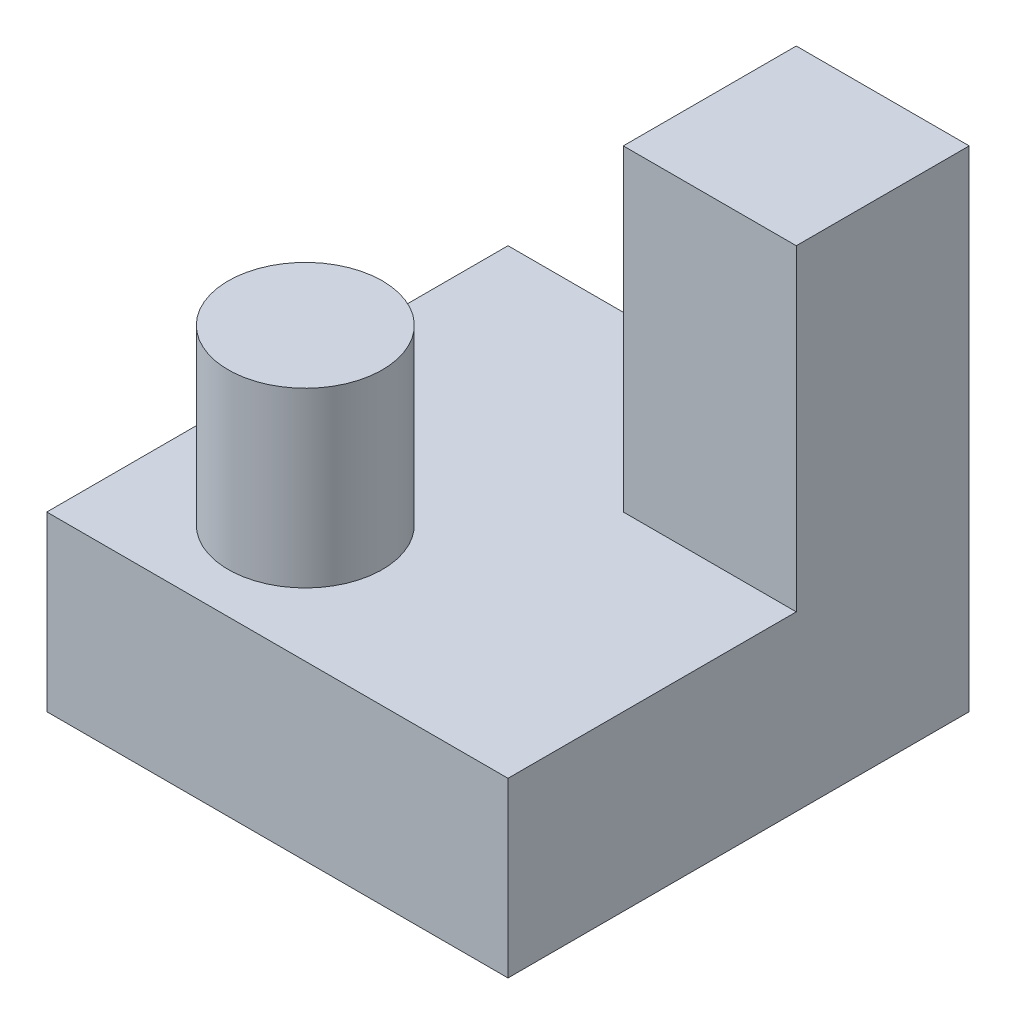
ISO-10303-21;
HEADER;
FILE_DESCRIPTION(('STEP AP214'),'2;1');
FILE_NAME('part.step','',(''),(''),'','','');
FILE_SCHEMA(('AUTOMOTIVE_DESIGN { 1 0 10303 214 1 1 1 1 }'));
ENDSEC;
DATA;
#1=APPLICATION_CONTEXT('core data for automotive mechanical design processes');
#2=APPLICATION_PROTOCOL_DEFINITION('international standard','automotive_design',2000,#1);
#3=PRODUCT_CONTEXT('',#1,'mechanical');
#4=PRODUCT('Part','Part','',(#3));
#5=PRODUCT_RELATED_PRODUCT_CATEGORY('part','',(#4));
#6=PRODUCT_DEFINITION_FORMATION('','',#4);
#7=PRODUCT_DEFINITION_CONTEXT('part definition',#1,'design');
#8=PRODUCT_DEFINITION('design','',#6,#7);
#9=PRODUCT_DEFINITION_SHAPE('','',#8);
#10=(LENGTH_UNIT() NAMED_UNIT(*) SI_UNIT(.MILLI.,.METRE.));
#11=(NAMED_UNIT(*) PLANE_ANGLE_UNIT() SI_UNIT($,.RADIAN.));
#12=(NAMED_UNIT(*) SI_UNIT($,.STERADIAN.) SOLID_ANGLE_UNIT());
#13=UNCERTAINTY_MEASURE_WITH_UNIT(LENGTH_MEASURE(1.E-05),#10,'distance_accuracy_value','');
#14=(GEOMETRIC_REPRESENTATION_CONTEXT(3) GLOBAL_UNCERTAINTY_ASSIGNED_CONTEXT((#13)) GLOBAL_UNIT_ASSIGNED_CONTEXT((#10,
#11,#12)) REPRESENTATION_CONTEXT('',''));
#15=CARTESIAN_POINT('',(0.,0.,0.));
#16=DIRECTION('',(0.,0.,1.));
#17=DIRECTION('',(1.,0.,0.));
#18=AXIS2_PLACEMENT_3D('',#15,#16,#17);
#19=CARTESIAN_POINT('',(0.,38.1,-101.6));
#20=DIRECTION('',(0.,-1.,0.));
#21=DIRECTION('',(0.,0.,-1.));
#22=AXIS2_PLACEMENT_3D('',#19,#20,#21);
#23=PLANE('',#22);
#24=CARTESIAN_POINT('',(30.963637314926,38.1,-25.9876638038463));
#25=DIRECTION('',(0.,-1.,0.));
#26=DIRECTION('',(0.,0.,-1.));
#27=AXIS2_PLACEMENT_3D('',#24,#25,#26);
#28=CIRCLE('',#27,16.9839539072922);
#29=CARTESIAN_POINT('',(30.963637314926,38.1,-42.9716177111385));
#30=VERTEX_POINT('',#29);
#31=EDGE_CURVE('E11',#30,#30,#28,.F.);
#32=ORIENTED_EDGE('',*,*,#31,.F.);
#33=EDGE_LOOP('',(#32));
#34=FACE_BOUND('',#33,.T.);
#35=DIRECTION('',(0.,0.,1.));
#36=VECTOR('',#35,1.);
#37=CARTESIAN_POINT('',(63.5,38.1,-101.6));
#38=LINE('',#37,#36);
#39=CARTESIAN_POINT('',(63.5,38.1,-101.6));
#40=VERTEX_POINT('',#39);
#41=CARTESIAN_POINT('',(63.5,38.1,-63.5));
#42=VERTEX_POINT('',#41);
#43=EDGE_CURVE('E117',#40,#42,#38,.T.);
#44=ORIENTED_EDGE('',*,*,#43,.F.);
#45=DIRECTION('',(-1.,0.,0.));
#46=VECTOR('',#45,1.);
#47=CARTESIAN_POINT('',(0.,38.1,-101.6));
#48=LINE('',#47,#46);
#49=CARTESIAN_POINT('',(0.,38.1,-101.6));
#50=VERTEX_POINT('',#49);
#51=EDGE_CURVE('E140',#40,#50,#48,.T.);
#52=ORIENTED_EDGE('',*,*,#51,.T.);
#53=DIRECTION('',(0.,0.,1.));
#54=VECTOR('',#53,1.);
#55=CARTESIAN_POINT('',(0.,38.1,0.));
#56=LINE('',#55,#54);
#57=CARTESIAN_POINT('',(0.,38.1,0.));
#58=VERTEX_POINT('',#57);
#59=EDGE_CURVE('E133',#50,#58,#56,.T.);
#60=ORIENTED_EDGE('',*,*,#59,.T.);
#61=DIRECTION('',(1.,0.,0.));
#62=VECTOR('',#61,1.);
#63=CARTESIAN_POINT('',(0.,38.1,0.));
#64=LINE('',#63,#62);
#65=CARTESIAN_POINT('',(101.6,38.1,0.));
#66=VERTEX_POINT('',#65);
#67=EDGE_CURVE('E136',#58,#66,#64,.T.);
#68=ORIENTED_EDGE('',*,*,#67,.T.);
#69=DIRECTION('',(0.,0.,-1.));
#70=VECTOR('',#69,1.);
#71=CARTESIAN_POINT('',(101.6,38.1,0.));
#72=LINE('',#71,#70);
#73=CARTESIAN_POINT('',(101.6,38.1,-63.5));
#74=VERTEX_POINT('',#73);
#75=EDGE_CURVE('E51',#66,#74,#72,.T.);
#76=ORIENTED_EDGE('',*,*,#75,.T.);
#77=DIRECTION('',(1.,0.,0.));
#78=VECTOR('',#77,1.);
#79=CARTESIAN_POINT('',(101.6,38.1,-63.5));
#80=LINE('',#79,#78);
#81=EDGE_CURVE('E46',#42,#74,#80,.T.);
#82=ORIENTED_EDGE('',*,*,#81,.F.);
#83=EDGE_LOOP('',(#44,#52,#60,#68,#76,#82));
#84=FACE_BOUND('',#83,.T.);
#85=ADVANCED_FACE('F31',(#34,#84),#23,.F.);
#86=CARTESIAN_POINT('',(0.,38.1,0.));
#87=DIRECTION('',(1.,0.,0.));
#88=DIRECTION('',(0.,0.,-1.));
#89=AXIS2_PLACEMENT_3D('',#86,#87,#88);
#90=PLANE('',#89);
#91=DIRECTION('',(0.,0.,1.));
#92=VECTOR('',#91,1.);
#93=CARTESIAN_POINT('',(0.,0.,0.));
#94=LINE('',#93,#92);
#95=CARTESIAN_POINT('',(0.,0.,-101.6));
#96=VERTEX_POINT('',#95);
#97=CARTESIAN_POINT('',(0.,0.,0.));
#98=VERTEX_POINT('',#97);
#99=EDGE_CURVE('E132',#96,#98,#94,.T.);
#100=ORIENTED_EDGE('',*,*,#99,.T.);
#101=DIRECTION('',(0.,-1.,0.));
#102=VECTOR('',#101,1.);
#103=CARTESIAN_POINT('',(0.,38.1,0.));
#104=LINE('',#103,#102);
#105=EDGE_CURVE('E39',#58,#98,#104,.T.);
#106=ORIENTED_EDGE('',*,*,#105,.F.);
#107=ORIENTED_EDGE('',*,*,#59,.F.);
#108=DIRECTION('',(0.,-1.,0.));
#109=VECTOR('',#108,1.);
#110=CARTESIAN_POINT('',(0.,38.1,-101.6));
#111=LINE('',#110,#109);
#112=EDGE_CURVE('E101',#50,#96,#111,.T.);
#113=ORIENTED_EDGE('',*,*,#112,.T.);
#114=EDGE_LOOP('',(#100,#106,#107,#113));
#115=FACE_BOUND('',#114,.T.);
#116=ADVANCED_FACE('F33',(#115),#90,.F.);
#117=CARTESIAN_POINT('',(0.,38.1,0.));
#118=DIRECTION('',(0.,0.,-1.));
#119=DIRECTION('',(-1.,0.,0.));
#120=AXIS2_PLACEMENT_3D('',#117,#118,#119);
#121=PLANE('',#120);
#122=DIRECTION('',(1.,0.,0.));
#123=VECTOR('',#122,1.);
#124=CARTESIAN_POINT('',(0.,0.,0.));
#125=LINE('',#124,#123);
#126=CARTESIAN_POINT('',(101.6,0.,0.));
#127=VERTEX_POINT('',#126);
#128=EDGE_CURVE('E144',#98,#127,#125,.T.);
#129=ORIENTED_EDGE('',*,*,#128,.T.);
#130=DIRECTION('',(0.,-1.,0.));
#131=VECTOR('',#130,1.);
#132=CARTESIAN_POINT('',(101.6,38.1,0.));
#133=LINE('',#132,#131);
#134=EDGE_CURVE('E100',#66,#127,#133,.T.);
#135=ORIENTED_EDGE('',*,*,#134,.F.);
#136=ORIENTED_EDGE('',*,*,#67,.F.);
#137=ORIENTED_EDGE('',*,*,#105,.T.);
#138=EDGE_LOOP('',(#129,#135,#136,#137));
#139=FACE_BOUND('',#138,.T.);
#140=ADVANCED_FACE('F153',(#139),#121,.F.);
#141=CARTESIAN_POINT('',(101.6,38.1,0.));
#142=DIRECTION('',(-1.,0.,0.));
#143=DIRECTION('',(0.,0.,1.));
#144=AXIS2_PLACEMENT_3D('',#141,#142,#143);
#145=PLANE('',#144);
#146=DIRECTION('',(0.,0.,-1.));
#147=VECTOR('',#146,1.);
#148=CARTESIAN_POINT('',(101.6,0.,0.));
#149=LINE('',#148,#147);
#150=CARTESIAN_POINT('',(101.6,0.,-101.6));
#151=VERTEX_POINT('',#150);
#152=EDGE_CURVE('E97',#127,#151,#149,.T.);
#153=ORIENTED_EDGE('',*,*,#152,.T.);
#154=DIRECTION('',(0.,-1.,0.));
#155=VECTOR('',#154,1.);
#156=CARTESIAN_POINT('',(101.6,38.1,-101.6));
#157=LINE('',#156,#155);
#158=CARTESIAN_POINT('',(101.6,107.95,-101.6));
#159=VERTEX_POINT('',#158);
#160=EDGE_CURVE('E89',#159,#151,#157,.T.);
#161=ORIENTED_EDGE('',*,*,#160,.F.);
#162=DIRECTION('',(0.,0.,-1.));
#163=VECTOR('',#162,1.);
#164=CARTESIAN_POINT('',(101.6,107.95,-101.6));
#165=LINE('',#164,#163);
#166=CARTESIAN_POINT('',(101.6,107.95,-63.5));
#167=VERTEX_POINT('',#166);
#168=EDGE_CURVE('E94',#167,#159,#165,.T.);
#169=ORIENTED_EDGE('',*,*,#168,.F.);
#170=DIRECTION('',(0.,-1.,0.));
#171=VECTOR('',#170,1.);
#172=CARTESIAN_POINT('',(101.6,107.95,-63.5));
#173=LINE('',#172,#171);
#174=EDGE_CURVE('E122',#167,#74,#173,.T.);
#175=ORIENTED_EDGE('',*,*,#174,.T.);
#176=ORIENTED_EDGE('',*,*,#75,.F.);
#177=ORIENTED_EDGE('',*,*,#134,.T.);
#178=EDGE_LOOP('',(#153,#161,#169,#175,#176,#177));
#179=FACE_BOUND('',#178,.T.);
#180=ADVANCED_FACE('F91',(#179),#145,.F.);
#181=CARTESIAN_POINT('',(0.,38.1,-101.6));
#182=DIRECTION('',(0.,0.,1.));
#183=DIRECTION('',(1.,0.,0.));
#184=AXIS2_PLACEMENT_3D('',#181,#182,#183);
#185=PLANE('',#184);
#186=DIRECTION('',(-1.,0.,0.));
#187=VECTOR('',#186,1.);
#188=CARTESIAN_POINT('',(0.,0.,-101.6));
#189=LINE('',#188,#187);
#190=EDGE_CURVE('E137',#151,#96,#189,.T.);
#191=ORIENTED_EDGE('',*,*,#190,.T.);
#192=ORIENTED_EDGE('',*,*,#112,.F.);
#193=ORIENTED_EDGE('',*,*,#51,.F.);
#194=DIRECTION('',(0.,-1.,0.));
#195=VECTOR('',#194,1.);
#196=CARTESIAN_POINT('',(63.5,107.95,-101.6));
#197=LINE('',#196,#195);
#198=CARTESIAN_POINT('',(63.5,107.95,-101.6));
#199=VERTEX_POINT('',#198);
#200=EDGE_CURVE('E107',#199,#40,#197,.T.);
#201=ORIENTED_EDGE('',*,*,#200,.F.);
#202=DIRECTION('',(-1.,0.,0.));
#203=VECTOR('',#202,1.);
#204=CARTESIAN_POINT('',(101.6,107.95,-101.6));
#205=LINE('',#204,#203);
#206=EDGE_CURVE('E104',#159,#199,#205,.T.);
#207=ORIENTED_EDGE('',*,*,#206,.F.);
#208=ORIENTED_EDGE('',*,*,#160,.T.);
#209=EDGE_LOOP('',(#191,#192,#193,#201,#207,#208));
#210=FACE_BOUND('',#209,.T.);
#211=ADVANCED_FACE('F105',(#210),#185,.F.);
#212=CARTESIAN_POINT('',(0.,0.,-101.6));
#213=DIRECTION('',(0.,-1.,0.));
#214=DIRECTION('',(0.,0.,-1.));
#215=AXIS2_PLACEMENT_3D('',#212,#213,#214);
#216=PLANE('',#215);
#217=ORIENTED_EDGE('',*,*,#99,.F.);
#218=ORIENTED_EDGE('',*,*,#190,.F.);
#219=ORIENTED_EDGE('',*,*,#152,.F.);
#220=ORIENTED_EDGE('',*,*,#128,.F.);
#221=EDGE_LOOP('',(#217,#218,#219,#220));
#222=FACE_BOUND('',#221,.T.);
#223=ADVANCED_FACE('F160',(#222),#216,.T.);
#224=CARTESIAN_POINT('',(30.963637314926,76.2,-25.9876638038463));
#225=DIRECTION('',(0.,-1.,0.));
#226=DIRECTION('',(0.,0.,-1.));
#227=AXIS2_PLACEMENT_3D('',#224,#225,#226);
#228=CYLINDRICAL_SURFACE('',#227,16.9839539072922);
#229=CARTESIAN_POINT('',(30.963637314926,76.2,-25.9876638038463));
#230=DIRECTION('',(0.,1.,0.));
#231=DIRECTION('',(0.,0.,1.));
#232=AXIS2_PLACEMENT_3D('',#229,#230,#231);
#233=CIRCLE('',#232,16.9839539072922);
#234=CARTESIAN_POINT('',(30.963637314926,76.2,-42.9716177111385));
#235=VERTEX_POINT('',#234);
#236=EDGE_CURVE('E129',#235,#235,#233,.T.);
#237=CARTESIAN_POINT('',(30.963637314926,76.2,-42.9716177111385));
#238=CARTESIAN_POINT('',(30.963637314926,75.803125,-42.9716177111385));
#239=CARTESIAN_POINT('',(30.963637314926,75.40625,-42.9716177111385));
#240=CARTESIAN_POINT('',(30.963637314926,74.6125,-42.9716177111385));
#241=CARTESIAN_POINT('',(30.963637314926,74.215625,-42.9716177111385));
#242=CARTESIAN_POINT('',(30.963637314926,73.421875,-42.9716177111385));
#243=CARTESIAN_POINT('',(30.963637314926,73.025,-42.9716177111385));
#244=CARTESIAN_POINT('',(30.963637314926,72.23125,-42.9716177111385));
#245=CARTESIAN_POINT('',(30.963637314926,71.834375,-42.9716177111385));
#246=CARTESIAN_POINT('',(30.963637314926,71.040625,-42.9716177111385));
#247=CARTESIAN_POINT('',(30.963637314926,70.64375,-42.9716177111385));
#248=CARTESIAN_POINT('',(30.963637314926,69.85,-42.9716177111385));
#249=CARTESIAN_POINT('',(30.963637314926,69.453125,-42.9716177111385));
#250=CARTESIAN_POINT('',(30.963637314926,68.659375,-42.9716177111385));
#251=CARTESIAN_POINT('',(30.963637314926,68.2625,-42.9716177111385));
#252=CARTESIAN_POINT('',(30.963637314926,67.46875,-42.9716177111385));
#253=CARTESIAN_POINT('',(30.963637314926,67.071875,-42.9716177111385));
#254=CARTESIAN_POINT('',(30.963637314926,66.278125,-42.9716177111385));
#255=CARTESIAN_POINT('',(30.963637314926,65.88125,-42.9716177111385));
#256=CARTESIAN_POINT('',(30.963637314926,65.0875,-42.9716177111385));
#257=CARTESIAN_POINT('',(30.963637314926,64.690625,-42.9716177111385));
#258=CARTESIAN_POINT('',(30.963637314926,63.896875,-42.9716177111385));
#259=CARTESIAN_POINT('',(30.963637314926,63.5,-42.9716177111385));
#260=CARTESIAN_POINT('',(30.963637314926,62.70625,-42.9716177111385));
#261=CARTESIAN_POINT('',(30.963637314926,62.309375,-42.9716177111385));
#262=CARTESIAN_POINT('',(30.963637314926,61.515625,-42.9716177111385));
#263=CARTESIAN_POINT('',(30.963637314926,61.11875,-42.9716177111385));
#264=CARTESIAN_POINT('',(30.963637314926,60.325,-42.9716177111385));
#265=CARTESIAN_POINT('',(30.963637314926,59.928125,-42.9716177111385));
#266=CARTESIAN_POINT('',(30.963637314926,59.134375,-42.9716177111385));
#267=CARTESIAN_POINT('',(30.963637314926,58.7375,-42.9716177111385));
#268=CARTESIAN_POINT('',(30.963637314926,57.94375,-42.9716177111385));
#269=CARTESIAN_POINT('',(30.963637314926,57.546875,-42.9716177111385));
#270=CARTESIAN_POINT('',(30.963637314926,56.753125,-42.9716177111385));
#271=CARTESIAN_POINT('',(30.963637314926,56.35625,-42.9716177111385));
#272=CARTESIAN_POINT('',(30.963637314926,55.5625,-42.9716177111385));
#273=CARTESIAN_POINT('',(30.963637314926,55.165625,-42.9716177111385));
#274=CARTESIAN_POINT('',(30.963637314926,54.371875,-42.9716177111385));
#275=CARTESIAN_POINT('',(30.963637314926,53.975,-42.9716177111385));
#276=CARTESIAN_POINT('',(30.963637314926,53.18125,-42.9716177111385));
#277=CARTESIAN_POINT('',(30.963637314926,52.784375,-42.9716177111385));
#278=CARTESIAN_POINT('',(30.963637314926,51.990625,-42.9716177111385));
#279=CARTESIAN_POINT('',(30.963637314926,51.59375,-42.9716177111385));
#280=CARTESIAN_POINT('',(30.963637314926,50.8,-42.9716177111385));
#281=CARTESIAN_POINT('',(30.963637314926,50.403125,-42.9716177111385));
#282=CARTESIAN_POINT('',(30.963637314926,49.609375,-42.9716177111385));
#283=CARTESIAN_POINT('',(30.963637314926,49.2125,-42.9716177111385));
#284=CARTESIAN_POINT('',(30.963637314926,48.41875,-42.9716177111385));
#285=CARTESIAN_POINT('',(30.963637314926,48.021875,-42.9716177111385));
#286=CARTESIAN_POINT('',(30.963637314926,47.228125,-42.9716177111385));
#287=CARTESIAN_POINT('',(30.963637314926,46.83125,-42.9716177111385));
#288=CARTESIAN_POINT('',(30.963637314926,46.0375,-42.9716177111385));
#289=CARTESIAN_POINT('',(30.963637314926,45.640625,-42.9716177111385));
#290=CARTESIAN_POINT('',(30.963637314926,44.846875,-42.9716177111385));
#291=CARTESIAN_POINT('',(30.963637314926,44.45,-42.9716177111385));
#292=CARTESIAN_POINT('',(30.963637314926,43.65625,-42.9716177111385));
#293=CARTESIAN_POINT('',(30.963637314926,43.259375,-42.9716177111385));
#294=CARTESIAN_POINT('',(30.963637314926,42.465625,-42.9716177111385));
#295=CARTESIAN_POINT('',(30.963637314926,42.06875,-42.9716177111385));
#296=CARTESIAN_POINT('',(30.963637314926,41.275,-42.9716177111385));
#297=CARTESIAN_POINT('',(30.963637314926,40.878125,-42.9716177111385));
#298=CARTESIAN_POINT('',(30.963637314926,40.084375,-42.9716177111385));
#299=CARTESIAN_POINT('',(30.963637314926,39.6875,-42.9716177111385));
#300=CARTESIAN_POINT('',(30.963637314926,38.89375,-42.9716177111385));
#301=CARTESIAN_POINT('',(30.963637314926,38.496875,-42.9716177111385));
#302=CARTESIAN_POINT('',(30.963637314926,38.1,-42.9716177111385));
#303=B_SPLINE_CURVE_WITH_KNOTS('',3,(#237,#238,#239,#240,#241,#242,#243,#244,#245,#246,#247,
#248,#249,#250,#251,#252,#253,#254,#255,#256,#257,#258,#259,#260,#261,#262,#263,#264,#265,#266,
#267,#268,#269,#270,#271,#272,#273,#274,#275,#276,#277,#278,#279,#280,#281,#282,#283,#284,#285,
#286,#287,#288,#289,#290,#291,#292,#293,#294,#295,#296,#297,#298,#299,#300,#301,#302),
.UNSPECIFIED.,.F.,.F.,(4,2,2,2,2,2,2,2,2,2,2,2,2,2,2,2,2,2,2,2,2,2,2,2,2,2,2,2,2,2,2,2,4),(0.,
1.19062499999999,2.38124999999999,3.57187499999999,4.76249999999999,5.95312499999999,
7.14374999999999,8.33437499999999,9.52499999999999,10.715625,11.90625,13.096875,14.2875,
15.478125,16.66875,17.859375,19.05,20.240625,21.43125,22.621875,23.8125,25.003125,26.19375,
27.384375,28.575,29.765625,30.95625,32.146875,33.3375,34.528125,35.71875,36.909375,38.1),.UNSPECIFIED.);
#304=EDGE_CURVE('BSEAM184',#235,#30,#303,.T.);
#305=ORIENTED_EDGE('',*,*,#236,.F.);
#306=ORIENTED_EDGE('',*,*,#31,.T.);
#307=ORIENTED_EDGE('',*,*,#304,.T.);
#308=ORIENTED_EDGE('',*,*,#304,.F.);
#309=EDGE_LOOP('',(#305,#307,#306,#308));
#310=FACE_BOUND('',#309,.T.);
#311=ADVANCED_FACE('F184',(#310),#228,.T.);
#312=CARTESIAN_POINT('',(30.963637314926,76.2,-25.9876638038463));
#313=DIRECTION('',(0.,1.,0.));
#314=DIRECTION('',(0.,0.,1.));
#315=AXIS2_PLACEMENT_3D('',#312,#313,#314);
#316=PLANE('',#315);
#317=ORIENTED_EDGE('',*,*,#236,.T.);
#318=EDGE_LOOP('',(#317));
#319=FACE_BOUND('',#318,.T.);
#320=ADVANCED_FACE('F173',(#319),#316,.T.);
#321=CARTESIAN_POINT('',(63.5,107.95,-101.6));
#322=DIRECTION('',(1.,0.,0.));
#323=DIRECTION('',(0.,0.,-1.));
#324=AXIS2_PLACEMENT_3D('',#321,#322,#323);
#325=PLANE('',#324);
#326=ORIENTED_EDGE('',*,*,#43,.T.);
#327=DIRECTION('',(0.,-1.,0.));
#328=VECTOR('',#327,1.);
#329=CARTESIAN_POINT('',(63.5,107.95,-63.5));
#330=LINE('',#329,#328);
#331=CARTESIAN_POINT('',(63.5,107.95,-63.5));
#332=VERTEX_POINT('',#331);
#333=EDGE_CURVE('E125',#332,#42,#330,.T.);
#334=ORIENTED_EDGE('',*,*,#333,.F.);
#335=DIRECTION('',(0.,0.,1.));
#336=VECTOR('',#335,1.);
#337=CARTESIAN_POINT('',(63.5,107.95,-101.6));
#338=LINE('',#337,#336);
#339=EDGE_CURVE('E110',#199,#332,#338,.T.);
#340=ORIENTED_EDGE('',*,*,#339,.F.);
#341=ORIENTED_EDGE('',*,*,#200,.T.);
#342=EDGE_LOOP('',(#326,#334,#340,#341));
#343=FACE_BOUND('',#342,.T.);
#344=ADVANCED_FACE('F163',(#343),#325,.F.);
#345=CARTESIAN_POINT('',(101.6,107.95,-63.5));
#346=DIRECTION('',(0.,0.,-1.));
#347=DIRECTION('',(-1.,0.,0.));
#348=AXIS2_PLACEMENT_3D('',#345,#346,#347);
#349=PLANE('',#348);
#350=ORIENTED_EDGE('',*,*,#81,.T.);
#351=ORIENTED_EDGE('',*,*,#174,.F.);
#352=DIRECTION('',(1.,0.,0.));
#353=VECTOR('',#352,1.);
#354=CARTESIAN_POINT('',(101.6,107.95,-63.5));
#355=LINE('',#354,#353);
#356=EDGE_CURVE('E114',#332,#167,#355,.T.);
#357=ORIENTED_EDGE('',*,*,#356,.F.);
#358=ORIENTED_EDGE('',*,*,#333,.T.);
#359=EDGE_LOOP('',(#350,#351,#357,#358));
#360=FACE_BOUND('',#359,.T.);
#361=ADVANCED_FACE('F165',(#360),#349,.F.);
#362=CARTESIAN_POINT('',(101.6,107.95,-63.5));
#363=DIRECTION('',(0.,-1.,0.));
#364=DIRECTION('',(0.,0.,-1.));
#365=AXIS2_PLACEMENT_3D('',#362,#363,#364);
#366=PLANE('',#365);
#367=ORIENTED_EDGE('',*,*,#168,.T.);
#368=ORIENTED_EDGE('',*,*,#206,.T.);
#369=ORIENTED_EDGE('',*,*,#339,.T.);
#370=ORIENTED_EDGE('',*,*,#356,.T.);
#371=EDGE_LOOP('',(#367,#368,#369,#370));
#372=FACE_BOUND('',#371,.T.);
#373=ADVANCED_FACE('F112',(#372),#366,.F.);
#374=CLOSED_SHELL('',(#85,#116,#140,#180,#211,#223,#311,#320,#344,#361,#373));
#375=MANIFOLD_SOLID_BREP('B2',#374);
#376=ADVANCED_BREP_SHAPE_REPRESENTATION('',(#18,#375),#14);
#377=SHAPE_DEFINITION_REPRESENTATION(#9,#376);
ENDSEC;
END-ISO-10303-21;
